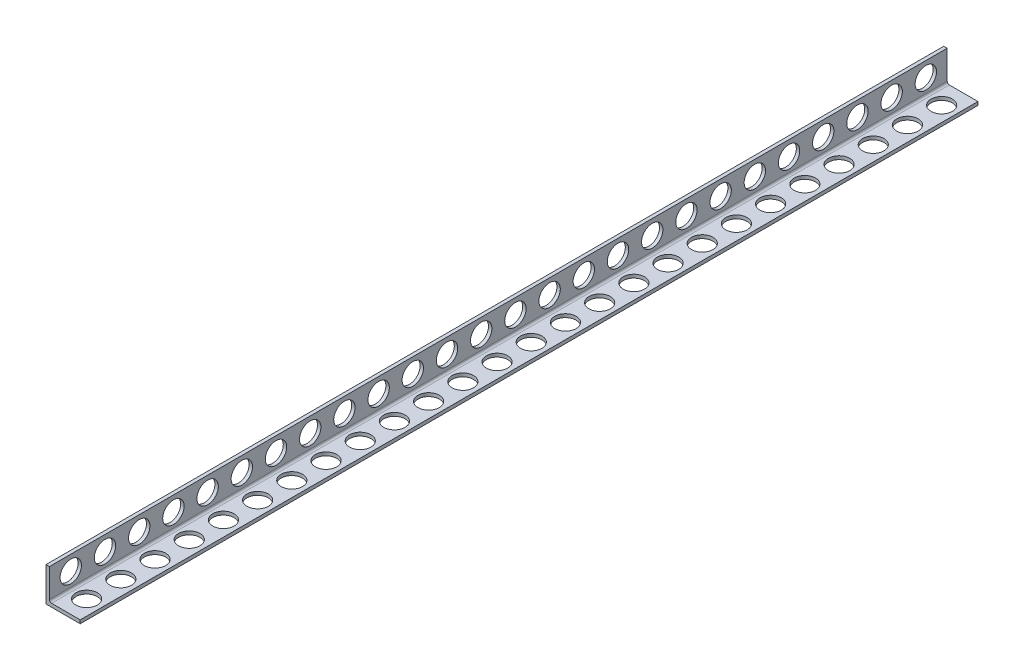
from build123d import *

# Parameters (mm, degrees)
EXTRUDE1_DEPTH     = 1050
FILLET1_R          = 5
SKETCH2_R          = 25
CUT_EXTRUDE1_DEPTH = 1057.07764866
SKETCH3_R          = 25
CUT_EXTRUDE2_DEPTH = 1054.225521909
LPATTERN1_COUNT    = 26
LPATTERN1_PITCH    = 80


with BuildPart() as part:
    # Sketch1 → Extrude1 (new, symmetric)
    with BuildSketch(Plane.XY):
        Polygon((-40, 0), (40, 0), (40, 8), (-32, 8), (-32, 80), (-40, 80), align=None)
    extrude(amount=EXTRUDE1_DEPTH, both=True)

    # Fillet1
    fillet1_edges = [part.edges().sort_by_distance(p)[0] for p in [
        (-32, 8, 0),
    ]]
    fillet(fillet1_edges, radius=FILLET1_R)

    # Sketch2 → Cut-Extrude1 (cut, through all)
    with BuildSketch(Plane.ZY.offset(40)):
        with Locations(Location((-1000, 45, 0), (0, 0, 270))):
            Circle(SKETCH2_R)
    cut_extrude1 = extrude(amount=-CUT_EXTRUDE1_DEPTH, mode=Mode.SUBTRACT)

    # Sketch3 → Cut-Extrude2 (cut, through all)
    with BuildSketch(Plane(origin=(0, 8, 0), x_dir=(-1, 0, 0), z_dir=(0, 1, 0))):
        with Locations(Location((-5, -1000, 0), (0, 0, 90))):
            Circle(SKETCH3_R)
    cut_extrude2 = extrude(amount=-CUT_EXTRUDE2_DEPTH, mode=Mode.SUBTRACT)

    # LPattern1: Cut-Extrude1, Cut-Extrude2 ×26
    with Locations(*[(0, 0, i * LPATTERN1_PITCH) for i in range(1, LPATTERN1_COUNT)]):
        add(cut_extrude1, mode=Mode.SUBTRACT)
        add(cut_extrude2, mode=Mode.SUBTRACT)


solid = part.part
